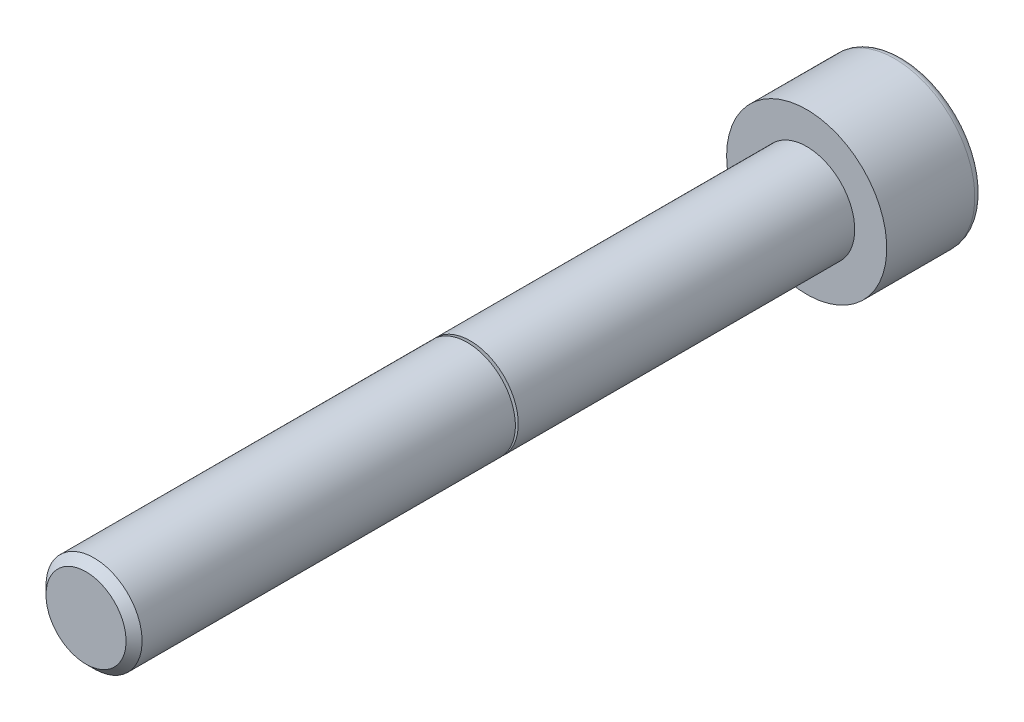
ISO-10303-21;
HEADER;
FILE_DESCRIPTION(('STEP AP214'),'2;1');
FILE_NAME('part.step','',(''),(''),'','','');
FILE_SCHEMA(('AUTOMOTIVE_DESIGN { 1 0 10303 214 1 1 1 1 }'));
ENDSEC;
DATA;
#1=APPLICATION_CONTEXT('core data for automotive mechanical design processes');
#2=APPLICATION_PROTOCOL_DEFINITION('international standard','automotive_design',2000,#1);
#3=PRODUCT_CONTEXT('',#1,'mechanical');
#4=PRODUCT('Part','Part','',(#3));
#5=PRODUCT_RELATED_PRODUCT_CATEGORY('part','',(#4));
#6=PRODUCT_DEFINITION_FORMATION('','',#4);
#7=PRODUCT_DEFINITION_CONTEXT('part definition',#1,'design');
#8=PRODUCT_DEFINITION('design','',#6,#7);
#9=PRODUCT_DEFINITION_SHAPE('','',#8);
#10=(LENGTH_UNIT() NAMED_UNIT(*) SI_UNIT(.MILLI.,.METRE.));
#11=(NAMED_UNIT(*) PLANE_ANGLE_UNIT() SI_UNIT($,.RADIAN.));
#12=(NAMED_UNIT(*) SI_UNIT($,.STERADIAN.) SOLID_ANGLE_UNIT());
#13=UNCERTAINTY_MEASURE_WITH_UNIT(LENGTH_MEASURE(1.E-05),#10,'distance_accuracy_value','');
#14=(GEOMETRIC_REPRESENTATION_CONTEXT(3) GLOBAL_UNCERTAINTY_ASSIGNED_CONTEXT((#13)) GLOBAL_UNIT_ASSIGNED_CONTEXT((#10,
#11,#12)) REPRESENTATION_CONTEXT('',''));
#15=CARTESIAN_POINT('',(0.,0.,0.));
#16=DIRECTION('',(0.,0.,1.));
#17=DIRECTION('',(1.,0.,0.));
#18=AXIS2_PLACEMENT_3D('',#15,#16,#17);
#19=CARTESIAN_POINT('',(0.,-5.27355936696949E-13,-5.50000000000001));
#20=DIRECTION('',(0.,0.,-1.));
#21=DIRECTION('',(-1.,0.,0.));
#22=AXIS2_PLACEMENT_3D('',#19,#20,#21);
#23=TOROIDAL_SURFACE('',#22,4.5,0.500000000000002);
#24=CARTESIAN_POINT('',(0.,-5.27355936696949E-13,-6.00000000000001));
#25=DIRECTION('',(0.,0.,-1.));
#26=DIRECTION('',(-1.,0.,0.));
#27=AXIS2_PLACEMENT_3D('',#24,#25,#26);
#28=CIRCLE('',#27,4.5);
#29=CARTESIAN_POINT('',(-4.5,-5.27355936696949E-13,-6.00000000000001));
#30=VERTEX_POINT('',#29);
#31=EDGE_CURVE('E182',#30,#30,#28,.T.);
#32=ORIENTED_EDGE('',*,*,#31,.F.);
#33=EDGE_LOOP('',(#32));
#34=FACE_BOUND('',#33,.T.);
#35=CARTESIAN_POINT('',(0.,-5.27355936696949E-13,-5.50000000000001));
#36=DIRECTION('',(0.,0.,-1.));
#37=DIRECTION('',(-1.,0.,0.));
#38=AXIS2_PLACEMENT_3D('',#35,#36,#37);
#39=CIRCLE('',#38,5.);
#40=CARTESIAN_POINT('',(-5.,-5.27355936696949E-13,-5.50000000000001));
#41=VERTEX_POINT('',#40);
#42=EDGE_CURVE('E11',#41,#41,#39,.T.);
#43=ORIENTED_EDGE('',*,*,#42,.T.);
#44=EDGE_LOOP('',(#43));
#45=FACE_BOUND('',#44,.T.);
#46=ADVANCED_FACE('F55',(#34,#45),#23,.T.);
#47=CARTESIAN_POINT('',(0.,-5.27355936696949E-13,-10.585154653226));
#48=DIRECTION('',(0.,0.,-1.));
#49=DIRECTION('',(-1.,0.,0.));
#50=AXIS2_PLACEMENT_3D('',#47,#48,#49);
#51=CYLINDRICAL_SURFACE('',#50,5.);
#52=ORIENTED_EDGE('',*,*,#42,.F.);
#53=EDGE_LOOP('',(#52));
#54=FACE_BOUND('',#53,.T.);
#55=CARTESIAN_POINT('',(0.,0.,0.));
#56=DIRECTION('',(0.,0.,-1.));
#57=DIRECTION('',(-1.,0.,0.));
#58=AXIS2_PLACEMENT_3D('',#55,#56,#57);
#59=CIRCLE('',#58,5.);
#60=CARTESIAN_POINT('',(-5.,0.,0.));
#61=VERTEX_POINT('',#60);
#62=EDGE_CURVE('E63',#61,#61,#59,.T.);
#63=ORIENTED_EDGE('',*,*,#62,.T.);
#64=EDGE_LOOP('',(#63));
#65=FACE_BOUND('',#64,.T.);
#66=ADVANCED_FACE('F227',(#54,#65),#51,.T.);
#67=CARTESIAN_POINT('',(-4.99999999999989,0.,0.));
#68=DIRECTION('',(0.,0.,-1.));
#69=DIRECTION('',(-1.,0.,0.));
#70=AXIS2_PLACEMENT_3D('',#67,#68,#69);
#71=PLANE('',#70);
#72=ORIENTED_EDGE('',*,*,#62,.F.);
#73=EDGE_LOOP('',(#72));
#74=FACE_BOUND('',#73,.T.);
#75=CARTESIAN_POINT('',(0.,0.,0.));
#76=DIRECTION('',(0.,0.,-1.));
#77=DIRECTION('',(-1.,0.,0.));
#78=AXIS2_PLACEMENT_3D('',#75,#76,#77);
#79=CIRCLE('',#78,3.);
#80=CARTESIAN_POINT('',(-3.,0.,0.));
#81=VERTEX_POINT('',#80);
#82=EDGE_CURVE('E219',#81,#81,#79,.T.);
#83=ORIENTED_EDGE('',*,*,#82,.T.);
#84=EDGE_LOOP('',(#83));
#85=FACE_BOUND('',#84,.T.);
#86=ADVANCED_FACE('F229',(#74,#85),#71,.F.);
#87=CARTESIAN_POINT('',(0.,-5.27355936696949E-13,-10.585154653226));
#88=DIRECTION('',(0.,0.,-1.));
#89=DIRECTION('',(-1.,0.,0.));
#90=AXIS2_PLACEMENT_3D('',#87,#88,#89);
#91=CYLINDRICAL_SURFACE('',#90,3.00000000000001);
#92=ORIENTED_EDGE('',*,*,#82,.F.);
#93=EDGE_LOOP('',(#92));
#94=FACE_BOUND('',#93,.T.);
#95=CARTESIAN_POINT('',(0.,0.,21.0100000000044));
#96=DIRECTION('',(0.,0.,-1.));
#97=DIRECTION('',(-1.,0.,0.));
#98=AXIS2_PLACEMENT_3D('',#95,#96,#97);
#99=CIRCLE('',#98,3.00000000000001);
#100=CARTESIAN_POINT('',(-3.00000000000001,0.,21.0100000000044));
#101=VERTEX_POINT('',#100);
#102=EDGE_CURVE('E215',#101,#101,#99,.T.);
#103=ORIENTED_EDGE('',*,*,#102,.T.);
#104=EDGE_LOOP('',(#103));
#105=FACE_BOUND('',#104,.T.);
#106=ADVANCED_FACE('F232',(#94,#105),#91,.T.);
#107=CARTESIAN_POINT('',(-3.00000000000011,0.,21.0100000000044));
#108=DIRECTION('',(0.,0.,-1.));
#109=DIRECTION('',(-1.,0.,0.));
#110=AXIS2_PLACEMENT_3D('',#107,#108,#109);
#111=PLANE('',#110);
#112=ORIENTED_EDGE('',*,*,#102,.F.);
#113=EDGE_LOOP('',(#112));
#114=FACE_BOUND('',#113,.T.);
#115=CARTESIAN_POINT('',(0.,0.,21.0100000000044));
#116=DIRECTION('',(0.,0.,-1.));
#117=DIRECTION('',(-1.,0.,0.));
#118=AXIS2_PLACEMENT_3D('',#115,#116,#117);
#119=CIRCLE('',#118,2.61342563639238);
#120=CARTESIAN_POINT('',(-2.61342563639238,0.,21.0100000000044));
#121=VERTEX_POINT('',#120);
#122=EDGE_CURVE('E211',#121,#121,#119,.T.);
#123=ORIENTED_EDGE('',*,*,#122,.T.);
#124=EDGE_LOOP('',(#123));
#125=FACE_BOUND('',#124,.T.);
#126=ADVANCED_FACE('F238',(#114,#125),#111,.F.);
#127=CARTESIAN_POINT('',(0.,0.,21.0300000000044));
#128=DIRECTION('',(0.,0.,-1.));
#129=DIRECTION('',(-1.,0.,0.));
#130=AXIS2_PLACEMENT_3D('',#127,#128,#129);
#131=TOROIDAL_SURFACE('',#130,2.61342563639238,0.0199999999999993);
#132=ORIENTED_EDGE('',*,*,#122,.F.);
#133=EDGE_LOOP('',(#132));
#134=FACE_BOUND('',#133,.T.);
#135=CARTESIAN_POINT('',(0.,0.,21.0487938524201));
#136=DIRECTION('',(0.,0.,-1.));
#137=DIRECTION('',(-1.,0.,0.));
#138=AXIS2_PLACEMENT_3D('',#135,#136,#137);
#139=CIRCLE('',#138,2.60658523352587);
#140=CARTESIAN_POINT('',(-2.60658523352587,0.,21.0487938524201));
#141=VERTEX_POINT('',#140);
#142=EDGE_CURVE('E207',#141,#141,#139,.T.);
#143=ORIENTED_EDGE('',*,*,#142,.T.);
#144=EDGE_LOOP('',(#143));
#145=FACE_BOUND('',#144,.T.);
#146=ADVANCED_FACE('F244',(#134,#145),#131,.F.);
#147=CARTESIAN_POINT('',(0.,0.,21.1919851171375));
#148=DIRECTION('',(0.,0.,1.));
#149=DIRECTION('',(1.,0.,0.));
#150=AXIS2_PLACEMENT_3D('',#147,#148,#149);
#151=CONICAL_SURFACE('',#150,3.00000000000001,1.22173047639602);
#152=ORIENTED_EDGE('',*,*,#142,.F.);
#153=EDGE_LOOP('',(#152));
#154=FACE_BOUND('',#153,.T.);
#155=CARTESIAN_POINT('',(0.,0.,21.1919851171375));
#156=DIRECTION('',(0.,0.,-1.));
#157=DIRECTION('',(-1.,0.,0.));
#158=AXIS2_PLACEMENT_3D('',#155,#156,#157);
#159=CIRCLE('',#158,3.00000000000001);
#160=CARTESIAN_POINT('',(-3.00000000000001,0.,21.1919851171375));
#161=VERTEX_POINT('',#160);
#162=EDGE_CURVE('E203',#161,#161,#159,.T.);
#163=ORIENTED_EDGE('',*,*,#162,.T.);
#164=EDGE_LOOP('',(#163));
#165=FACE_BOUND('',#164,.T.);
#166=ADVANCED_FACE('F250',(#154,#165),#151,.T.);
#167=CARTESIAN_POINT('',(0.,-5.27355936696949E-13,-10.585154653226));
#168=DIRECTION('',(0.,0.,-1.));
#169=DIRECTION('',(-1.,0.,0.));
#170=AXIS2_PLACEMENT_3D('',#167,#168,#169);
#171=CYLINDRICAL_SURFACE('',#170,3.00000000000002);
#172=ORIENTED_EDGE('',*,*,#162,.F.);
#173=EDGE_LOOP('',(#172));
#174=FACE_BOUND('',#173,.T.);
#175=CARTESIAN_POINT('',(0.,-1.87350135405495E-12,44.5000000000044));
#176=DIRECTION('',(0.,0.,-1.));
#177=DIRECTION('',(-1.,0.,0.));
#178=AXIS2_PLACEMENT_3D('',#175,#176,#177);
#179=CIRCLE('',#178,3.00000000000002);
#180=CARTESIAN_POINT('',(-3.00000000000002,-1.87350135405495E-12,44.5000000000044));
#181=VERTEX_POINT('',#180);
#182=EDGE_CURVE('E199',#181,#181,#179,.T.);
#183=ORIENTED_EDGE('',*,*,#182,.T.);
#184=EDGE_LOOP('',(#183));
#185=FACE_BOUND('',#184,.T.);
#186=ADVANCED_FACE('F256',(#174,#185),#171,.T.);
#187=CARTESIAN_POINT('',(0.,-1.87350135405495E-12,45.0000000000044));
#188=DIRECTION('',(0.,0.,-1.));
#189=DIRECTION('',(-1.,0.,0.));
#190=AXIS2_PLACEMENT_3D('',#187,#188,#189);
#191=CONICAL_SURFACE('',#190,2.50000000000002,0.785398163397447);
#192=ORIENTED_EDGE('',*,*,#182,.F.);
#193=EDGE_LOOP('',(#192));
#194=FACE_BOUND('',#193,.T.);
#195=CARTESIAN_POINT('',(0.,-1.87350135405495E-12,45.0000000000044));
#196=DIRECTION('',(0.,0.,-1.));
#197=DIRECTION('',(-1.,0.,0.));
#198=AXIS2_PLACEMENT_3D('',#195,#196,#197);
#199=CIRCLE('',#198,2.50000000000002);
#200=CARTESIAN_POINT('',(-2.50000000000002,-1.87350135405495E-12,45.0000000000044));
#201=VERTEX_POINT('',#200);
#202=EDGE_CURVE('E195',#201,#201,#199,.T.);
#203=ORIENTED_EDGE('',*,*,#202,.T.);
#204=EDGE_LOOP('',(#203));
#205=FACE_BOUND('',#204,.T.);
#206=ADVANCED_FACE('F262',(#194,#205),#191,.T.);
#207=CARTESIAN_POINT('',(-2.49999999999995,-1.87350135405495E-12,45.0000000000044));
#208=DIRECTION('',(0.,0.,-1.));
#209=DIRECTION('',(-1.,0.,0.));
#210=AXIS2_PLACEMENT_3D('',#207,#208,#209);
#211=PLANE('',#210);
#212=ORIENTED_EDGE('',*,*,#202,.F.);
#213=EDGE_LOOP('',(#212));
#214=FACE_BOUND('',#213,.T.);
#215=ADVANCED_FACE('F268',(#214),#211,.F.);
#216=CARTESIAN_POINT('',(0.,-5.27355936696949E-13,-6.00000000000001));
#217=DIRECTION('',(0.,0.,1.));
#218=DIRECTION('',(1.,0.,0.));
#219=AXIS2_PLACEMENT_3D('',#216,#217,#218);
#220=PLANE('',#219);
#221=DIRECTION('',(-0.5,-0.866025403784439,0.));
#222=VECTOR('',#221,1.);
#223=CARTESIAN_POINT('',(2.88675134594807,-5.27355936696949E-13,-6.00000000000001));
#224=LINE('',#223,#222);
#225=CARTESIAN_POINT('',(2.88675134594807,-5.27355936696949E-13,-6.00000000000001));
#226=VERTEX_POINT('',#225);
#227=CARTESIAN_POINT('',(1.44337567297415,-2.50000000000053,-6.00000000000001));
#228=VERTEX_POINT('',#227);
#229=EDGE_CURVE('E163',#226,#228,#224,.T.);
#230=ORIENTED_EDGE('',*,*,#229,.F.);
#231=DIRECTION('',(0.5,-0.866025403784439,0.));
#232=VECTOR('',#231,1.);
#233=CARTESIAN_POINT('',(1.44337567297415,2.49999999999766,-6.00000000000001));
#234=LINE('',#233,#232);
#235=CARTESIAN_POINT('',(1.44337567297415,2.49999999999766,-6.00000000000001));
#236=VERTEX_POINT('',#235);
#237=EDGE_CURVE('E73',#236,#226,#234,.T.);
#238=ORIENTED_EDGE('',*,*,#237,.F.);
#239=DIRECTION('',(1.,0.,0.));
#240=VECTOR('',#239,1.);
#241=CARTESIAN_POINT('',(-1.44337567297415,2.49999999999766,-6.00000000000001));
#242=LINE('',#241,#240);
#243=CARTESIAN_POINT('',(-1.44337567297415,2.49999999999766,-6.00000000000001));
#244=VERTEX_POINT('',#243);
#245=EDGE_CURVE('E176',#244,#236,#242,.T.);
#246=ORIENTED_EDGE('',*,*,#245,.F.);
#247=DIRECTION('',(0.5,0.866025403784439,0.));
#248=VECTOR('',#247,1.);
#249=CARTESIAN_POINT('',(-2.88675134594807,-5.27355936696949E-13,-6.00000000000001));
#250=LINE('',#249,#248);
#251=CARTESIAN_POINT('',(-2.88675134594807,-5.27355936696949E-13,-6.00000000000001));
#252=VERTEX_POINT('',#251);
#253=EDGE_CURVE('E173',#252,#244,#250,.T.);
#254=ORIENTED_EDGE('',*,*,#253,.F.);
#255=DIRECTION('',(-0.5,0.866025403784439,0.));
#256=VECTOR('',#255,1.);
#257=CARTESIAN_POINT('',(-1.44337567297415,-2.50000000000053,-6.00000000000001));
#258=LINE('',#257,#256);
#259=CARTESIAN_POINT('',(-1.44337567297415,-2.50000000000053,-6.00000000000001));
#260=VERTEX_POINT('',#259);
#261=EDGE_CURVE('E130',#260,#252,#258,.T.);
#262=ORIENTED_EDGE('',*,*,#261,.F.);
#263=DIRECTION('',(-1.,0.,0.));
#264=VECTOR('',#263,1.);
#265=CARTESIAN_POINT('',(1.44337567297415,-2.50000000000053,-6.00000000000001));
#266=LINE('',#265,#264);
#267=EDGE_CURVE('E167',#228,#260,#266,.T.);
#268=ORIENTED_EDGE('',*,*,#267,.F.);
#269=EDGE_LOOP('',(#230,#238,#246,#254,#262,#268));
#270=FACE_BOUND('',#269,.T.);
#271=ORIENTED_EDGE('',*,*,#31,.T.);
#272=EDGE_LOOP('',(#271));
#273=FACE_BOUND('',#272,.T.);
#274=ADVANCED_FACE('F273',(#270,#273),#220,.F.);
#275=CARTESIAN_POINT('',(1.44337567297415,2.49999999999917,-3.5));
#276=DIRECTION('',(0.866025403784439,0.5,0.));
#277=DIRECTION('',(-0.5,0.866025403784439,0.));
#278=AXIS2_PLACEMENT_3D('',#275,#276,#277);
#279=PLANE('',#278);
#280=ORIENTED_EDGE('',*,*,#237,.T.);
#281=DIRECTION('',(0.,0.,-1.));
#282=VECTOR('',#281,1.);
#283=CARTESIAN_POINT('',(2.88675134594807,0.,-3.5));
#284=LINE('',#283,#282);
#285=CARTESIAN_POINT('',(2.88675134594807,0.,-3.5));
#286=VERTEX_POINT('',#285);
#287=EDGE_CURVE('E110',#286,#226,#284,.T.);
#288=ORIENTED_EDGE('',*,*,#287,.F.);
#289=DIRECTION('',(0.5,-0.866025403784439,0.));
#290=VECTOR('',#289,1.);
#291=CARTESIAN_POINT('',(1.44337567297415,2.49999999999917,-3.5));
#292=LINE('',#291,#290);
#293=CARTESIAN_POINT('',(1.44337567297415,2.49999999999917,-3.5));
#294=VERTEX_POINT('',#293);
#295=EDGE_CURVE('E179',#294,#286,#292,.T.);
#296=ORIENTED_EDGE('',*,*,#295,.F.);
#297=DIRECTION('',(0.,0.,-1.));
#298=VECTOR('',#297,1.);
#299=CARTESIAN_POINT('',(1.44337567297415,2.49999999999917,-3.5));
#300=LINE('',#299,#298);
#301=EDGE_CURVE('E83',#294,#236,#300,.T.);
#302=ORIENTED_EDGE('',*,*,#301,.T.);
#303=EDGE_LOOP('',(#280,#288,#296,#302));
#304=FACE_BOUND('',#303,.T.);
#305=ADVANCED_FACE('F279',(#304),#279,.F.);
#306=CARTESIAN_POINT('',(-1.44337567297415,2.49999999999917,-3.5));
#307=DIRECTION('',(0.,1.,0.));
#308=DIRECTION('',(0.,0.,1.));
#309=AXIS2_PLACEMENT_3D('',#306,#307,#308);
#310=PLANE('',#309);
#311=ORIENTED_EDGE('',*,*,#245,.T.);
#312=ORIENTED_EDGE('',*,*,#301,.F.);
#313=DIRECTION('',(1.,0.,0.));
#314=VECTOR('',#313,1.);
#315=CARTESIAN_POINT('',(-1.44337567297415,2.49999999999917,-3.5));
#316=LINE('',#315,#314);
#317=CARTESIAN_POINT('',(-1.44337567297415,2.49999999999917,-3.5));
#318=VERTEX_POINT('',#317);
#319=EDGE_CURVE('E144',#318,#294,#316,.T.);
#320=ORIENTED_EDGE('',*,*,#319,.F.);
#321=DIRECTION('',(0.,0.,-1.));
#322=VECTOR('',#321,1.);
#323=CARTESIAN_POINT('',(-1.44337567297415,2.49999999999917,-3.5));
#324=LINE('',#323,#322);
#325=EDGE_CURVE('E135',#318,#244,#324,.T.);
#326=ORIENTED_EDGE('',*,*,#325,.T.);
#327=EDGE_LOOP('',(#311,#312,#320,#326));
#328=FACE_BOUND('',#327,.T.);
#329=ADVANCED_FACE('F345',(#328),#310,.F.);
#330=CARTESIAN_POINT('',(-2.88675134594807,0.,-3.5));
#331=DIRECTION('',(-0.866025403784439,0.5,0.));
#332=DIRECTION('',(-0.5,-0.866025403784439,0.));
#333=AXIS2_PLACEMENT_3D('',#330,#331,#332);
#334=PLANE('',#333);
#335=ORIENTED_EDGE('',*,*,#253,.T.);
#336=ORIENTED_EDGE('',*,*,#325,.F.);
#337=DIRECTION('',(0.5,0.866025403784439,0.));
#338=VECTOR('',#337,1.);
#339=CARTESIAN_POINT('',(-2.88675134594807,0.,-3.5));
#340=LINE('',#339,#338);
#341=CARTESIAN_POINT('',(-2.88675134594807,0.,-3.5));
#342=VERTEX_POINT('',#341);
#343=EDGE_CURVE('E139',#342,#318,#340,.T.);
#344=ORIENTED_EDGE('',*,*,#343,.F.);
#345=DIRECTION('',(0.,0.,-1.));
#346=VECTOR('',#345,1.);
#347=CARTESIAN_POINT('',(-2.88675134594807,0.,-3.5));
#348=LINE('',#347,#346);
#349=EDGE_CURVE('E123',#342,#252,#348,.T.);
#350=ORIENTED_EDGE('',*,*,#349,.T.);
#351=EDGE_LOOP('',(#335,#336,#344,#350));
#352=FACE_BOUND('',#351,.T.);
#353=ADVANCED_FACE('F140',(#352),#334,.F.);
#354=CARTESIAN_POINT('',(-1.44337567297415,-2.5,-3.5));
#355=DIRECTION('',(-0.866025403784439,-0.5,0.));
#356=DIRECTION('',(0.5,-0.866025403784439,0.));
#357=AXIS2_PLACEMENT_3D('',#354,#355,#356);
#358=PLANE('',#357);
#359=ORIENTED_EDGE('',*,*,#261,.T.);
#360=ORIENTED_EDGE('',*,*,#349,.F.);
#361=DIRECTION('',(-0.5,0.866025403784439,0.));
#362=VECTOR('',#361,1.);
#363=CARTESIAN_POINT('',(-1.44337567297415,-2.5,-3.5));
#364=LINE('',#363,#362);
#365=CARTESIAN_POINT('',(-1.44337567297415,-2.5,-3.5));
#366=VERTEX_POINT('',#365);
#367=EDGE_CURVE('E127',#366,#342,#364,.T.);
#368=ORIENTED_EDGE('',*,*,#367,.F.);
#369=DIRECTION('',(0.,0.,-1.));
#370=VECTOR('',#369,1.);
#371=CARTESIAN_POINT('',(-1.44337567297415,-2.5,-3.5));
#372=LINE('',#371,#370);
#373=EDGE_CURVE('E136',#366,#260,#372,.T.);
#374=ORIENTED_EDGE('',*,*,#373,.T.);
#375=EDGE_LOOP('',(#359,#360,#368,#374));
#376=FACE_BOUND('',#375,.T.);
#377=ADVANCED_FACE('F125',(#376),#358,.F.);
#378=CARTESIAN_POINT('',(1.44337567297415,-2.5,-3.5));
#379=DIRECTION('',(0.,-1.,0.));
#380=DIRECTION('',(0.,0.,-1.));
#381=AXIS2_PLACEMENT_3D('',#378,#379,#380);
#382=PLANE('',#381);
#383=ORIENTED_EDGE('',*,*,#267,.T.);
#384=ORIENTED_EDGE('',*,*,#373,.F.);
#385=DIRECTION('',(-1.,0.,0.));
#386=VECTOR('',#385,1.);
#387=CARTESIAN_POINT('',(1.44337567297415,-2.5,-3.5));
#388=LINE('',#387,#386);
#389=CARTESIAN_POINT('',(1.44337567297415,-2.5,-3.5));
#390=VERTEX_POINT('',#389);
#391=EDGE_CURVE('E150',#390,#366,#388,.T.);
#392=ORIENTED_EDGE('',*,*,#391,.F.);
#393=DIRECTION('',(0.,0.,-1.));
#394=VECTOR('',#393,1.);
#395=CARTESIAN_POINT('',(1.44337567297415,-2.5,-3.5));
#396=LINE('',#395,#394);
#397=EDGE_CURVE('E187',#390,#228,#396,.T.);
#398=ORIENTED_EDGE('',*,*,#397,.T.);
#399=EDGE_LOOP('',(#383,#384,#392,#398));
#400=FACE_BOUND('',#399,.T.);
#401=ADVANCED_FACE('F370',(#400),#382,.F.);
#402=CARTESIAN_POINT('',(2.88675134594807,0.,-3.5));
#403=DIRECTION('',(0.866025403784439,-0.5,0.));
#404=DIRECTION('',(0.5,0.866025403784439,0.));
#405=AXIS2_PLACEMENT_3D('',#402,#403,#404);
#406=PLANE('',#405);
#407=ORIENTED_EDGE('',*,*,#229,.T.);
#408=ORIENTED_EDGE('',*,*,#397,.F.);
#409=DIRECTION('',(-0.5,-0.866025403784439,0.));
#410=VECTOR('',#409,1.);
#411=CARTESIAN_POINT('',(2.88675134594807,0.,-3.5));
#412=LINE('',#411,#410);
#413=EDGE_CURVE('E155',#286,#390,#412,.T.);
#414=ORIENTED_EDGE('',*,*,#413,.F.);
#415=ORIENTED_EDGE('',*,*,#287,.T.);
#416=EDGE_LOOP('',(#407,#408,#414,#415));
#417=FACE_BOUND('',#416,.T.);
#418=ADVANCED_FACE('F379',(#417),#406,.F.);
#419=CARTESIAN_POINT('',(4.33012701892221,-2.5,-3.5));
#420=DIRECTION('',(0.,0.,-1.));
#421=DIRECTION('',(-1.,0.,0.));
#422=AXIS2_PLACEMENT_3D('',#419,#420,#421);
#423=PLANE('',#422);
#424=ORIENTED_EDGE('',*,*,#295,.T.);
#425=ORIENTED_EDGE('',*,*,#413,.T.);
#426=ORIENTED_EDGE('',*,*,#391,.T.);
#427=ORIENTED_EDGE('',*,*,#367,.T.);
#428=ORIENTED_EDGE('',*,*,#343,.T.);
#429=ORIENTED_EDGE('',*,*,#319,.T.);
#430=EDGE_LOOP('',(#424,#425,#426,#427,#428,#429));
#431=FACE_BOUND('',#430,.T.);
#432=ADVANCED_FACE('F147',(#431),#423,.T.);
#433=CLOSED_SHELL('',(#46,#66,#86,#106,#126,#146,#166,#186,#206,#215,#274,#305,#329,#353,#377,
#401,#418,#432));
#434=MANIFOLD_SOLID_BREP('B2',#433);
#435=ADVANCED_BREP_SHAPE_REPRESENTATION('',(#18,#434),#14);
#436=SHAPE_DEFINITION_REPRESENTATION(#9,#435);
ENDSEC;
END-ISO-10303-21;
